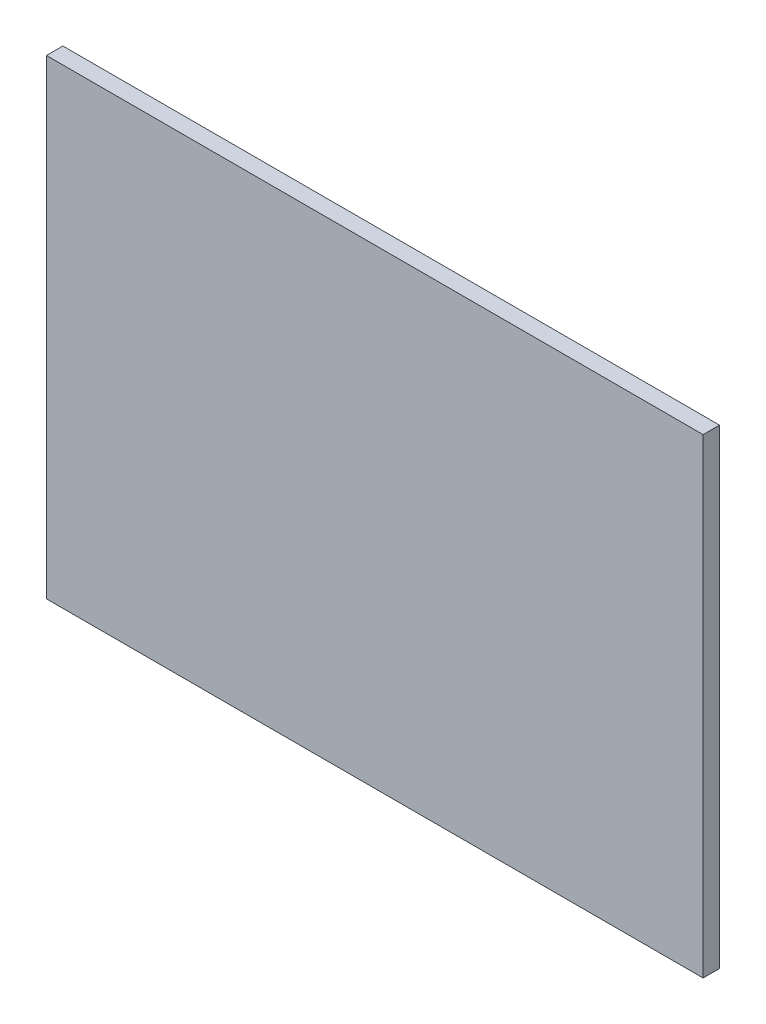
from build123d import *

# Parameters (mm, degrees)
CROQUIS1_W              = 600
CROQUIS1_H              = 430
SALIENTE_EXTRUIR1_DEPTH = 15


with BuildPart() as part:
    # Croquis1 → Saliente-Extruir1 (new body)
    with BuildSketch(Plane.XY):
        Rectangle(CROQUIS1_W, CROQUIS1_H)
    extrude(amount=SALIENTE_EXTRUIR1_DEPTH)


solid = part.part
